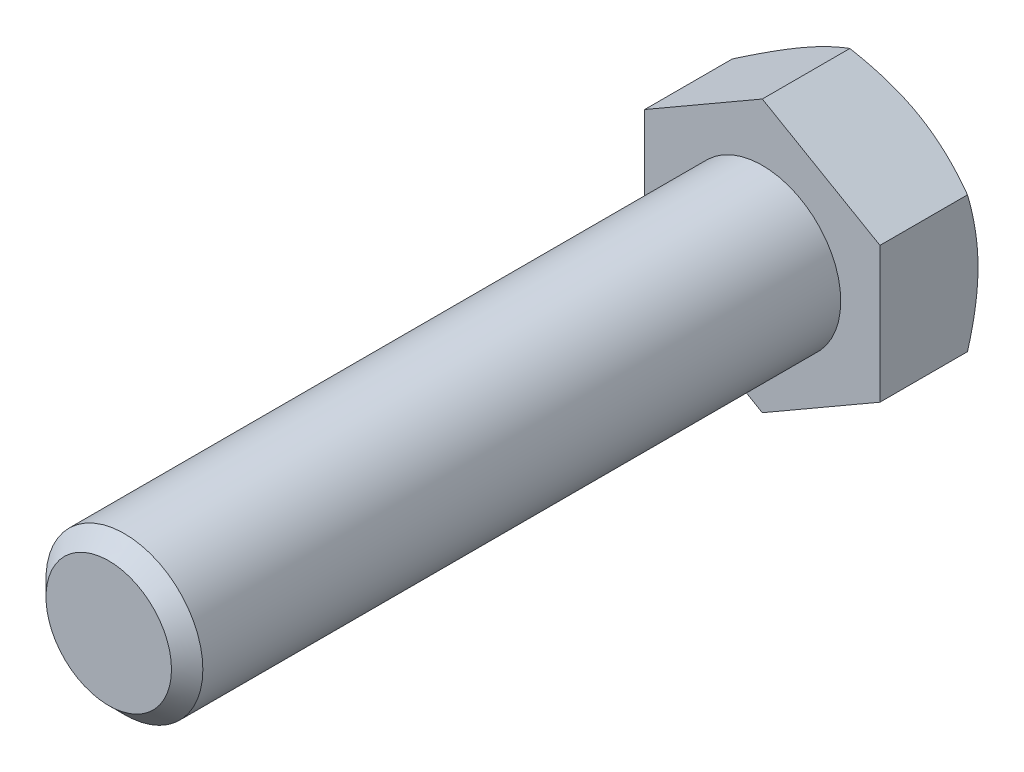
from build123d import *

# Parameters (mm, degrees)
ESQUISSE1_W        = 6
ESQUISSE1_H        = 50
CHANFREIN1_SIZE    = 1.2
BOSS_EXTRU_1_DEPTH = 7.5


with BuildPart() as part:
    # Esquisse1 → Base-R_volution (revolve)
    with BuildSketch(Plane(origin=(0, 0, 0), x_dir=(1, 0, 0), z_dir=(0, 1, 0))):
        with Locations((3, -25)):
            Rectangle(ESQUISSE1_W, ESQUISSE1_H)
    revolve(axis=Axis((0, 0, 0), (0, 0, 1)))

    # Chanfrein1
    chanfrein1_edges = [part.edges().sort_by_distance(p)[0] for p in [
        (-6, 0, 50),
    ]]
    chamfer(chanfrein1_edges, length=CHANFREIN1_SIZE)

    # Esquisse6 → Boss.-Extru.1 (add)
    with BuildSketch(Plane.XY):
        Polygon((9, -5.196152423), (9, 5.196152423), (0, 10.392304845), (-9, 5.196152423), (-9, -5.196152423), (0, -10.392304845), align=None)
    extrude(amount=-BOSS_EXTRU_1_DEPTH)

    # Esquisse7 → Enl_vement de mati_re-R_volution1 (revolve, cut)
    with BuildSketch(Plane(origin=(0, 0, 0), x_dir=(1, 0, 0), z_dir=(0, 1, 0))):
        Polygon((-9, 7.5), (-21.990381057, 7.5), (-21.990381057, 0), align=None)
    revolve(axis=Axis((0, 0, -6.239446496), (0, 0, 1)), mode=Mode.SUBTRACT)


solid = part.part
